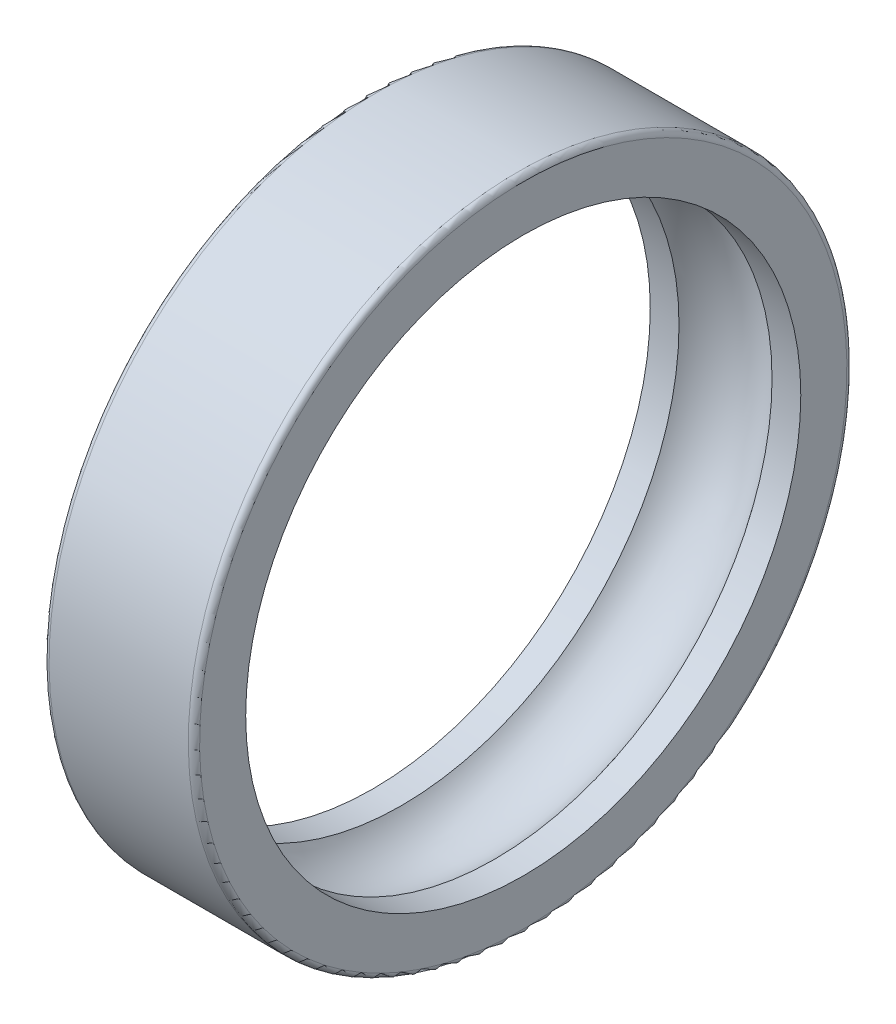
ISO-10303-21;
HEADER;
FILE_DESCRIPTION(('STEP AP214'),'2;1');
FILE_NAME('part.step','',(''),(''),'','','');
FILE_SCHEMA(('AUTOMOTIVE_DESIGN { 1 0 10303 214 1 1 1 1 }'));
ENDSEC;
DATA;
#1=APPLICATION_CONTEXT('core data for automotive mechanical design processes');
#2=APPLICATION_PROTOCOL_DEFINITION('international standard','automotive_design',2000,#1);
#3=PRODUCT_CONTEXT('',#1,'mechanical');
#4=PRODUCT('Part','Part','',(#3));
#5=PRODUCT_RELATED_PRODUCT_CATEGORY('part','',(#4));
#6=PRODUCT_DEFINITION_FORMATION('','',#4);
#7=PRODUCT_DEFINITION_CONTEXT('part definition',#1,'design');
#8=PRODUCT_DEFINITION('design','',#6,#7);
#9=PRODUCT_DEFINITION_SHAPE('','',#8);
#10=(LENGTH_UNIT() NAMED_UNIT(*) SI_UNIT(.MILLI.,.METRE.));
#11=(NAMED_UNIT(*) PLANE_ANGLE_UNIT() SI_UNIT($,.RADIAN.));
#12=(NAMED_UNIT(*) SI_UNIT($,.STERADIAN.) SOLID_ANGLE_UNIT());
#13=UNCERTAINTY_MEASURE_WITH_UNIT(LENGTH_MEASURE(1.E-05),#10,'distance_accuracy_value','');
#14=(GEOMETRIC_REPRESENTATION_CONTEXT(3) GLOBAL_UNCERTAINTY_ASSIGNED_CONTEXT((#13)) GLOBAL_UNIT_ASSIGNED_CONTEXT((#10,
#11,#12)) REPRESENTATION_CONTEXT('',''));
#15=CARTESIAN_POINT('',(0.,0.,0.));
#16=DIRECTION('',(0.,0.,1.));
#17=DIRECTION('',(1.,0.,0.));
#18=AXIS2_PLACEMENT_3D('',#15,#16,#17);
#19=CARTESIAN_POINT('',(4.,0.,0.));
#20=DIRECTION('',(1.,0.,0.));
#21=DIRECTION('',(0.,0.877582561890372,0.479425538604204));
#22=AXIS2_PLACEMENT_3D('',#19,#20,#21);
#23=TOROIDAL_SURFACE('',#22,13.05,3.);
#24=CARTESIAN_POINT('',(6.47184141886,0.,0.));
#25=DIRECTION('',(1.,0.,0.));
#26=DIRECTION('',(0.,0.,-1.));
#27=AXIS2_PLACEMENT_3D('',#24,#25,#26);
#28=CIRCLE('',#27,14.75);
#29=CARTESIAN_POINT('',(6.47184141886,0.,-14.75));
#30=VERTEX_POINT('',#29);
#31=EDGE_CURVE('E192',#30,#30,#28,.T.);
#32=ORIENTED_EDGE('',*,*,#31,.T.);
#33=EDGE_LOOP('',(#32));
#34=FACE_BOUND('',#33,.T.);
#35=CARTESIAN_POINT('',(1.52815858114,0.,0.));
#36=DIRECTION('',(1.,0.,0.));
#37=DIRECTION('',(0.,0.,-1.));
#38=AXIS2_PLACEMENT_3D('',#35,#36,#37);
#39=CIRCLE('',#38,14.75);
#40=CARTESIAN_POINT('',(1.52815858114,0.,-14.75));
#41=VERTEX_POINT('',#40);
#42=EDGE_CURVE('E62',#41,#41,#39,.F.);
#43=ORIENTED_EDGE('',*,*,#42,.T.);
#44=EDGE_LOOP('',(#43));
#45=FACE_BOUND('',#44,.T.);
#46=ADVANCED_FACE('F15',(#34,#45),#23,.F.);
#47=CARTESIAN_POINT('',(4.,0.,0.));
#48=DIRECTION('',(1.,0.,0.));
#49=DIRECTION('',(0.,0.,-1.));
#50=AXIS2_PLACEMENT_3D('',#47,#48,#49);
#51=CYLINDRICAL_SURFACE('',#50,14.75);
#52=CARTESIAN_POINT('',(8.,0.,0.));
#53=DIRECTION('',(1.,0.,0.));
#54=DIRECTION('',(0.,0.,-1.));
#55=AXIS2_PLACEMENT_3D('',#52,#53,#54);
#56=CIRCLE('',#55,14.75);
#57=CARTESIAN_POINT('',(8.,0.,-14.75));
#58=VERTEX_POINT('',#57);
#59=EDGE_CURVE('E188',#58,#58,#56,.F.);
#60=ORIENTED_EDGE('',*,*,#59,.F.);
#61=EDGE_LOOP('',(#60));
#62=FACE_BOUND('',#61,.T.);
#63=ORIENTED_EDGE('',*,*,#31,.F.);
#64=EDGE_LOOP('',(#63));
#65=FACE_BOUND('',#64,.T.);
#66=ADVANCED_FACE('F133',(#62,#65),#51,.F.);
#67=CARTESIAN_POINT('',(4.,0.,0.));
#68=DIRECTION('',(1.,0.,0.));
#69=DIRECTION('',(0.,0.,-1.));
#70=AXIS2_PLACEMENT_3D('',#67,#68,#69);
#71=CYLINDRICAL_SURFACE('',#70,14.75);
#72=ORIENTED_EDGE('',*,*,#42,.F.);
#73=EDGE_LOOP('',(#72));
#74=FACE_BOUND('',#73,.T.);
#75=CARTESIAN_POINT('',(0.,0.,0.));
#76=DIRECTION('',(1.,0.,0.));
#77=DIRECTION('',(0.,0.,-1.));
#78=AXIS2_PLACEMENT_3D('',#75,#76,#77);
#79=CIRCLE('',#78,14.75);
#80=CARTESIAN_POINT('',(0.,0.,-14.75));
#81=VERTEX_POINT('',#80);
#82=EDGE_CURVE('E51',#81,#81,#79,.F.);
#83=ORIENTED_EDGE('',*,*,#82,.T.);
#84=EDGE_LOOP('',(#83));
#85=FACE_BOUND('',#84,.T.);
#86=ADVANCED_FACE('F118',(#74,#85),#71,.F.);
#87=CARTESIAN_POINT('',(8.,14.75,0.));
#88=DIRECTION('',(1.,0.,0.));
#89=DIRECTION('',(0.,0.,-1.));
#90=AXIS2_PLACEMENT_3D('',#87,#88,#89);
#91=PLANE('',#90);
#92=ORIENTED_EDGE('',*,*,#59,.T.);
#93=EDGE_LOOP('',(#92));
#94=FACE_BOUND('',#93,.T.);
#95=CARTESIAN_POINT('',(8.,0.,0.));
#96=DIRECTION('',(-1.,0.,0.));
#97=DIRECTION('',(0.,0.877582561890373,0.479425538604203));
#98=AXIS2_PLACEMENT_3D('',#95,#96,#97);
#99=CIRCLE('',#98,17.1999999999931);
#100=CARTESIAN_POINT('',(8.,15.0944200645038,8.24611926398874));
#101=VERTEX_POINT('',#100);
#102=CARTESIAN_POINT('',(8.,-15.094420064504,-8.24611926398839));
#103=VERTEX_POINT('',#102);
#104=EDGE_CURVE('E44',#101,#103,#99,.T.);
#105=ORIENTED_EDGE('',*,*,#104,.F.);
#106=CARTESIAN_POINT('',(8.,0.,0.));
#107=DIRECTION('',(-1.,0.,0.));
#108=DIRECTION('',(0.,-0.877582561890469,-0.479425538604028));
#109=AXIS2_PLACEMENT_3D('',#106,#107,#108);
#110=CIRCLE('',#109,17.1999999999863);
#111=EDGE_CURVE('E47',#103,#101,#110,.T.);
#112=ORIENTED_EDGE('',*,*,#111,.F.);
#113=EDGE_LOOP('',(#105,#112));
#114=FACE_BOUND('',#113,.T.);
#115=ADVANCED_FACE('F49',(#94,#114),#91,.T.);
#116=CARTESIAN_POINT('',(0.,17.2,0.));
#117=DIRECTION('',(1.,0.,0.));
#118=DIRECTION('',(0.,0.,-1.));
#119=AXIS2_PLACEMENT_3D('',#116,#117,#118);
#120=PLANE('',#119);
#121=ORIENTED_EDGE('',*,*,#82,.F.);
#122=EDGE_LOOP('',(#121));
#123=FACE_BOUND('',#122,.T.);
#124=CARTESIAN_POINT('',(0.,0.,0.));
#125=DIRECTION('',(1.,0.,0.));
#126=DIRECTION('',(0.,-0.877582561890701,-0.479425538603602));
#127=AXIS2_PLACEMENT_3D('',#124,#125,#126);
#128=CIRCLE('',#127,17.1999999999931);
#129=CARTESIAN_POINT('',(0.,-15.0944200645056,-8.24611926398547));
#130=VERTEX_POINT('',#129);
#131=CARTESIAN_POINT('',(0.,15.0944200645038,8.24611926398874));
#132=VERTEX_POINT('',#131);
#133=EDGE_CURVE('E56',#130,#132,#128,.T.);
#134=ORIENTED_EDGE('',*,*,#133,.F.);
#135=CARTESIAN_POINT('',(0.,0.,0.));
#136=DIRECTION('',(1.,0.,0.));
#137=DIRECTION('',(0.,0.877582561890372,0.479425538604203));
#138=AXIS2_PLACEMENT_3D('',#135,#136,#137);
#139=CIRCLE('',#138,17.1999999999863);
#140=EDGE_CURVE('E35',#132,#130,#139,.T.);
#141=ORIENTED_EDGE('',*,*,#140,.F.);
#142=EDGE_LOOP('',(#134,#141));
#143=FACE_BOUND('',#142,.T.);
#144=ADVANCED_FACE('F74',(#123,#143),#120,.F.);
#145=CARTESIAN_POINT('',(7.7,0.,0.));
#146=DIRECTION('',(1.,0.,0.));
#147=DIRECTION('',(0.,0.877582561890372,0.479425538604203));
#148=AXIS2_PLACEMENT_3D('',#145,#146,#147);
#149=TOROIDAL_SURFACE('',#148,17.2,0.3);
#150=CARTESIAN_POINT('',(7.7,0.,0.));
#151=DIRECTION('',(1.,0.,0.));
#152=DIRECTION('',(0.,0.,-1.));
#153=AXIS2_PLACEMENT_3D('',#150,#151,#152);
#154=CIRCLE('',#153,17.5);
#155=CARTESIAN_POINT('',(7.7,0.,-17.5));
#156=VERTEX_POINT('',#155);
#157=EDGE_CURVE('E27',#156,#156,#154,.F.);
#158=ORIENTED_EDGE('',*,*,#157,.F.);
#159=EDGE_LOOP('',(#158));
#160=FACE_BOUND('',#159,.T.);
#161=ORIENTED_EDGE('',*,*,#104,.T.);
#162=ORIENTED_EDGE('',*,*,#111,.T.);
#163=EDGE_LOOP('',(#161,#162));
#164=FACE_BOUND('',#163,.T.);
#165=ADVANCED_FACE('F55',(#160,#164),#149,.T.);
#166=CARTESIAN_POINT('',(0.3,0.,0.));
#167=DIRECTION('',(1.,0.,0.));
#168=DIRECTION('',(0.,0.877582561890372,0.479425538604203));
#169=AXIS2_PLACEMENT_3D('',#166,#167,#168);
#170=TOROIDAL_SURFACE('',#169,17.2,0.3);
#171=ORIENTED_EDGE('',*,*,#140,.T.);
#172=ORIENTED_EDGE('',*,*,#133,.T.);
#173=EDGE_LOOP('',(#171,#172));
#174=FACE_BOUND('',#173,.T.);
#175=CARTESIAN_POINT('',(0.3,0.,0.));
#176=DIRECTION('',(1.,0.,0.));
#177=DIRECTION('',(0.,0.,-1.));
#178=AXIS2_PLACEMENT_3D('',#175,#176,#177);
#179=CIRCLE('',#178,17.5);
#180=CARTESIAN_POINT('',(0.3,0.,-17.5));
#181=VERTEX_POINT('',#180);
#182=EDGE_CURVE('E10',#181,#181,#179,.T.);
#183=ORIENTED_EDGE('',*,*,#182,.F.);
#184=EDGE_LOOP('',(#183));
#185=FACE_BOUND('',#184,.T.);
#186=ADVANCED_FACE('F73',(#174,#185),#170,.T.);
#187=CARTESIAN_POINT('',(4.,0.,0.));
#188=DIRECTION('',(1.,0.,0.));
#189=DIRECTION('',(0.,0.,-1.));
#190=AXIS2_PLACEMENT_3D('',#187,#188,#189);
#191=CYLINDRICAL_SURFACE('',#190,17.5);
#192=ORIENTED_EDGE('',*,*,#182,.T.);
#193=EDGE_LOOP('',(#192));
#194=FACE_BOUND('',#193,.T.);
#195=ORIENTED_EDGE('',*,*,#157,.T.);
#196=EDGE_LOOP('',(#195));
#197=FACE_BOUND('',#196,.T.);
#198=ADVANCED_FACE('F17',(#194,#197),#191,.T.);
#199=CLOSED_SHELL('',(#46,#66,#86,#115,#144,#165,#186,#198));
#200=MANIFOLD_SOLID_BREP('B1',#199);
#201=ADVANCED_BREP_SHAPE_REPRESENTATION('',(#18,#200),#14);
#202=SHAPE_DEFINITION_REPRESENTATION(#9,#201);
ENDSEC;
END-ISO-10303-21;
